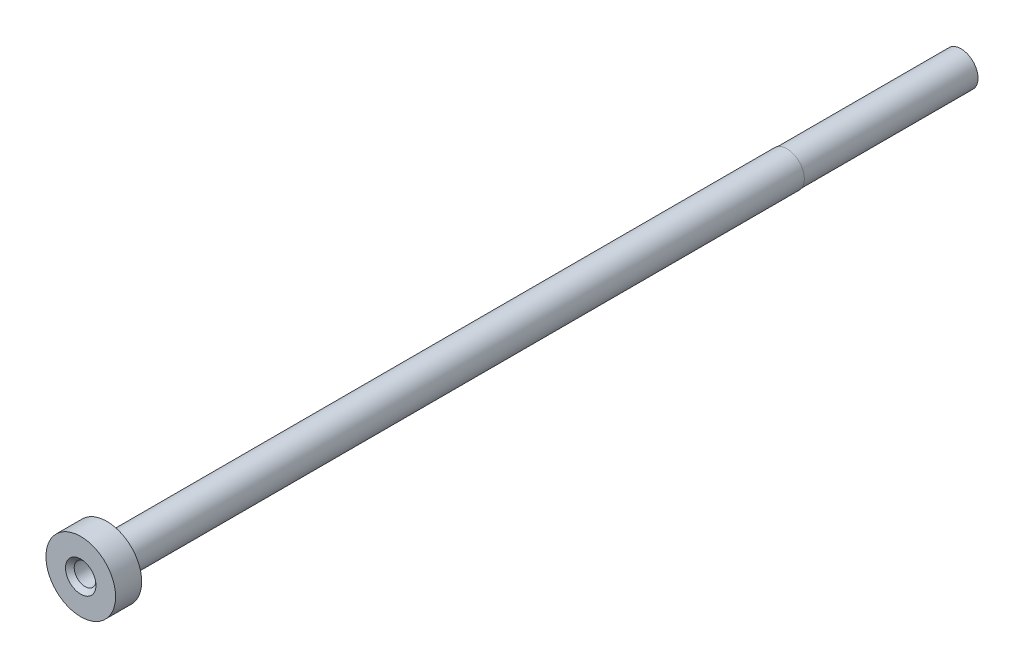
ISO-10303-21;
HEADER;
FILE_DESCRIPTION(('STEP AP214'),'2;1');
FILE_NAME('part.step','',(''),(''),'','','');
FILE_SCHEMA(('AUTOMOTIVE_DESIGN { 1 0 10303 214 1 1 1 1 }'));
ENDSEC;
DATA;
#1=APPLICATION_CONTEXT('core data for automotive mechanical design processes');
#2=APPLICATION_PROTOCOL_DEFINITION('international standard','automotive_design',2000,#1);
#3=PRODUCT_CONTEXT('',#1,'mechanical');
#4=PRODUCT('Part','Part','',(#3));
#5=PRODUCT_RELATED_PRODUCT_CATEGORY('part','',(#4));
#6=PRODUCT_DEFINITION_FORMATION('','',#4);
#7=PRODUCT_DEFINITION_CONTEXT('part definition',#1,'design');
#8=PRODUCT_DEFINITION('design','',#6,#7);
#9=PRODUCT_DEFINITION_SHAPE('','',#8);
#10=(LENGTH_UNIT() NAMED_UNIT(*) SI_UNIT(.MILLI.,.METRE.));
#11=(NAMED_UNIT(*) PLANE_ANGLE_UNIT() SI_UNIT($,.RADIAN.));
#12=(NAMED_UNIT(*) SI_UNIT($,.STERADIAN.) SOLID_ANGLE_UNIT());
#13=UNCERTAINTY_MEASURE_WITH_UNIT(LENGTH_MEASURE(1.E-05),#10,'distance_accuracy_value','');
#14=(GEOMETRIC_REPRESENTATION_CONTEXT(3) GLOBAL_UNCERTAINTY_ASSIGNED_CONTEXT((#13)) GLOBAL_UNIT_ASSIGNED_CONTEXT((#10,
#11,#12)) REPRESENTATION_CONTEXT('',''));
#15=CARTESIAN_POINT('',(0.,0.,0.));
#16=DIRECTION('',(0.,0.,1.));
#17=DIRECTION('',(1.,0.,0.));
#18=AXIS2_PLACEMENT_3D('',#15,#16,#17);
#19=CARTESIAN_POINT('',(-24.54585,-0.509249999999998,-101.12425));
#20=DIRECTION('',(0.,0.,1.));
#21=DIRECTION('',(1.,0.,0.));
#22=AXIS2_PLACEMENT_3D('',#19,#20,#21);
#23=PLANE('',#22);
#24=CARTESIAN_POINT('',(0.,0.,-101.12425));
#25=DIRECTION('',(0.,0.,1.));
#26=DIRECTION('',(1.,0.,0.));
#27=AXIS2_PLACEMENT_3D('',#24,#25,#26);
#28=CIRCLE('',#27,1.1);
#29=CARTESIAN_POINT('',(1.1,0.,-101.12425));
#30=VERTEX_POINT('',#29);
#31=EDGE_CURVE('E61',#30,#30,#28,.F.);
#32=ORIENTED_EDGE('',*,*,#31,.F.);
#33=EDGE_LOOP('',(#32));
#34=FACE_BOUND('',#33,.T.);
#35=CARTESIAN_POINT('',(0.,0.,-101.12425));
#36=DIRECTION('',(0.,0.,-1.));
#37=DIRECTION('',(-1.,0.,0.));
#38=AXIS2_PLACEMENT_3D('',#35,#36,#37);
#39=CIRCLE('',#38,1.95256100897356);
#40=CARTESIAN_POINT('',(-1.95256100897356,0.,-101.12425));
#41=VERTEX_POINT('',#40);
#42=EDGE_CURVE('E67',#41,#41,#39,.T.);
#43=ORIENTED_EDGE('',*,*,#42,.T.);
#44=EDGE_LOOP('',(#43));
#45=FACE_BOUND('',#44,.T.);
#46=ADVANCED_FACE('F29',(#34,#45),#23,.F.);
#47=CARTESIAN_POINT('',(0.,0.,-3.));
#48=DIRECTION('',(0.,0.,1.));
#49=DIRECTION('',(1.,0.,0.));
#50=AXIS2_PLACEMENT_3D('',#47,#48,#49);
#51=PLANE('',#50);
#52=CARTESIAN_POINT('',(0.,0.,-3.));
#53=DIRECTION('',(0.,0.,1.));
#54=DIRECTION('',(1.,0.,0.));
#55=AXIS2_PLACEMENT_3D('',#52,#53,#54);
#56=CIRCLE('',#55,2.3);
#57=CARTESIAN_POINT('',(2.3,0.,-3.));
#58=VERTEX_POINT('',#57);
#59=EDGE_CURVE('E40',#58,#58,#56,.T.);
#60=ORIENTED_EDGE('',*,*,#59,.T.);
#61=EDGE_LOOP('',(#60));
#62=FACE_BOUND('',#61,.T.);
#63=CARTESIAN_POINT('',(0.,0.,-3.));
#64=DIRECTION('',(0.,0.,1.));
#65=DIRECTION('',(1.,0.,0.));
#66=AXIS2_PLACEMENT_3D('',#63,#64,#65);
#67=CIRCLE('',#66,4.);
#68=CARTESIAN_POINT('',(4.,0.,-3.));
#69=VERTEX_POINT('',#68);
#70=EDGE_CURVE('E49',#69,#69,#67,.T.);
#71=ORIENTED_EDGE('',*,*,#70,.F.);
#72=EDGE_LOOP('',(#71));
#73=FACE_BOUND('',#72,.T.);
#74=ADVANCED_FACE('F90',(#62,#73),#51,.F.);
#75=CARTESIAN_POINT('',(0.,0.,-3.));
#76=DIRECTION('',(0.,0.,1.));
#77=DIRECTION('',(1.,0.,0.));
#78=AXIS2_PLACEMENT_3D('',#75,#76,#77);
#79=CYLINDRICAL_SURFACE('',#78,4.);
#80=ORIENTED_EDGE('',*,*,#70,.T.);
#81=EDGE_LOOP('',(#80));
#82=FACE_BOUND('',#81,.T.);
#83=CARTESIAN_POINT('',(0.,0.,0.));
#84=DIRECTION('',(0.,0.,1.));
#85=DIRECTION('',(1.,0.,0.));
#86=AXIS2_PLACEMENT_3D('',#83,#84,#85);
#87=CIRCLE('',#86,4.);
#88=CARTESIAN_POINT('',(4.,0.,0.));
#89=VERTEX_POINT('',#88);
#90=EDGE_CURVE('E52',#89,#89,#87,.T.);
#91=ORIENTED_EDGE('',*,*,#90,.F.);
#92=EDGE_LOOP('',(#91));
#93=FACE_BOUND('',#92,.T.);
#94=ADVANCED_FACE('F31',(#82,#93),#79,.T.);
#95=CARTESIAN_POINT('',(0.,0.,0.));
#96=DIRECTION('',(0.,0.,1.));
#97=DIRECTION('',(1.,0.,0.));
#98=AXIS2_PLACEMENT_3D('',#95,#96,#97);
#99=PLANE('',#98);
#100=CARTESIAN_POINT('',(0.,0.,0.));
#101=DIRECTION('',(0.,0.,1.));
#102=DIRECTION('',(1.,0.,0.));
#103=AXIS2_PLACEMENT_3D('',#100,#101,#102);
#104=CIRCLE('',#103,1.75);
#105=CARTESIAN_POINT('',(1.75,0.,0.));
#106=VERTEX_POINT('',#105);
#107=EDGE_CURVE('E11',#106,#106,#104,.F.);
#108=ORIENTED_EDGE('',*,*,#107,.T.);
#109=EDGE_LOOP('',(#108));
#110=FACE_BOUND('',#109,.T.);
#111=ORIENTED_EDGE('',*,*,#90,.T.);
#112=EDGE_LOOP('',(#111));
#113=FACE_BOUND('',#112,.T.);
#114=ADVANCED_FACE('F119',(#110,#113),#99,.T.);
#115=CARTESIAN_POINT('',(0.,0.,-255.656854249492));
#116=DIRECTION('',(0.,0.,1.));
#117=DIRECTION('',(1.,0.,0.));
#118=AXIS2_PLACEMENT_3D('',#115,#116,#117);
#119=CYLINDRICAL_SURFACE('',#118,2.);
#120=CARTESIAN_POINT('',(0.,0.,-81.12425));
#121=DIRECTION('',(0.,0.,1.));
#122=DIRECTION('',(1.,0.,0.));
#123=AXIS2_PLACEMENT_3D('',#120,#121,#122);
#124=CIRCLE('',#123,2.);
#125=CARTESIAN_POINT('',(2.,0.,-81.12425));
#126=VERTEX_POINT('',#125);
#127=EDGE_CURVE('E68',#126,#126,#124,.F.);
#128=ORIENTED_EDGE('',*,*,#127,.F.);
#129=EDGE_LOOP('',(#128));
#130=FACE_BOUND('',#129,.T.);
#131=CARTESIAN_POINT('',(0.,0.,-3.30000000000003));
#132=DIRECTION('',(0.,0.,1.));
#133=DIRECTION('',(1.,0.,0.));
#134=AXIS2_PLACEMENT_3D('',#131,#132,#133);
#135=CIRCLE('',#134,2.);
#136=CARTESIAN_POINT('',(2.,0.,-3.30000000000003));
#137=VERTEX_POINT('',#136);
#138=EDGE_CURVE('E44',#137,#137,#135,.F.);
#139=ORIENTED_EDGE('',*,*,#138,.T.);
#140=EDGE_LOOP('',(#139));
#141=FACE_BOUND('',#140,.T.);
#142=ADVANCED_FACE('F116',(#130,#141),#119,.T.);
#143=CARTESIAN_POINT('',(0.,0.,-128.535533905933));
#144=DIRECTION('',(0.,0.,1.));
#145=DIRECTION('',(1.,0.,0.));
#146=AXIS2_PLACEMENT_3D('',#143,#144,#145);
#147=CYLINDRICAL_SURFACE('',#146,1.25);
#148=CARTESIAN_POINT('',(0.,0.,-0.5));
#149=DIRECTION('',(0.,0.,1.));
#150=DIRECTION('',(1.,0.,0.));
#151=AXIS2_PLACEMENT_3D('',#148,#149,#150);
#152=CIRCLE('',#151,1.25);
#153=CARTESIAN_POINT('',(1.25,0.,-0.5));
#154=VERTEX_POINT('',#153);
#155=EDGE_CURVE('E36',#154,#154,#152,.T.);
#156=ORIENTED_EDGE('',*,*,#155,.T.);
#157=EDGE_LOOP('',(#156));
#158=FACE_BOUND('',#157,.T.);
#159=CARTESIAN_POINT('',(0.,0.,-90.));
#160=DIRECTION('',(0.,0.,1.));
#161=DIRECTION('',(1.,0.,0.));
#162=AXIS2_PLACEMENT_3D('',#159,#160,#161);
#163=CIRCLE('',#162,1.25);
#164=CARTESIAN_POINT('',(1.25,0.,-90.));
#165=VERTEX_POINT('',#164);
#166=EDGE_CURVE('E55',#165,#165,#163,.F.);
#167=ORIENTED_EDGE('',*,*,#166,.T.);
#168=EDGE_LOOP('',(#167));
#169=FACE_BOUND('',#168,.T.);
#170=ADVANCED_FACE('F112',(#158,#169),#147,.F.);
#171=CARTESIAN_POINT('',(0.,0.,-90.));
#172=DIRECTION('',(0.,0.,1.));
#173=DIRECTION('',(1.,0.,0.));
#174=AXIS2_PLACEMENT_3D('',#171,#172,#173);
#175=PLANE('',#174);
#176=CARTESIAN_POINT('',(0.,0.,-90.));
#177=DIRECTION('',(0.,0.,1.));
#178=DIRECTION('',(1.,0.,0.));
#179=AXIS2_PLACEMENT_3D('',#176,#177,#178);
#180=CIRCLE('',#179,1.1);
#181=CARTESIAN_POINT('',(1.1,0.,-90.));
#182=VERTEX_POINT('',#181);
#183=EDGE_CURVE('E58',#182,#182,#180,.F.);
#184=ORIENTED_EDGE('',*,*,#183,.T.);
#185=EDGE_LOOP('',(#184));
#186=FACE_BOUND('',#185,.T.);
#187=ORIENTED_EDGE('',*,*,#166,.F.);
#188=EDGE_LOOP('',(#187));
#189=FACE_BOUND('',#188,.T.);
#190=ADVANCED_FACE('F108',(#186,#189),#175,.T.);
#191=CARTESIAN_POINT('',(0.,0.,0.001000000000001));
#192=DIRECTION('',(0.,0.,-1.));
#193=DIRECTION('',(-1.,0.,0.));
#194=AXIS2_PLACEMENT_3D('',#191,#192,#193);
#195=CYLINDRICAL_SURFACE('',#194,1.1);
#196=ORIENTED_EDGE('',*,*,#31,.T.);
#197=EDGE_LOOP('',(#196));
#198=FACE_BOUND('',#197,.T.);
#199=ORIENTED_EDGE('',*,*,#183,.F.);
#200=EDGE_LOOP('',(#199));
#201=FACE_BOUND('',#200,.T.);
#202=ADVANCED_FACE('F104',(#198,#201),#195,.F.);
#203=CARTESIAN_POINT('',(0.,0.,-3.30000000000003));
#204=DIRECTION('',(0.,0.,1.));
#205=DIRECTION('',(1.,0.,0.));
#206=AXIS2_PLACEMENT_3D('',#203,#204,#205);
#207=TOROIDAL_SURFACE('',#206,2.3,0.3);
#208=ORIENTED_EDGE('',*,*,#59,.F.);
#209=EDGE_LOOP('',(#208));
#210=FACE_BOUND('',#209,.T.);
#211=ORIENTED_EDGE('',*,*,#138,.F.);
#212=EDGE_LOOP('',(#211));
#213=FACE_BOUND('',#212,.T.);
#214=ADVANCED_FACE('F100',(#210,#213),#207,.F.);
#215=CARTESIAN_POINT('',(0.,0.,-0.5));
#216=DIRECTION('',(0.,0.,1.));
#217=DIRECTION('',(1.,0.,0.));
#218=AXIS2_PLACEMENT_3D('',#215,#216,#217);
#219=CONICAL_SURFACE('',#218,1.25,0.78539816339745);
#220=ORIENTED_EDGE('',*,*,#107,.F.);
#221=EDGE_LOOP('',(#220));
#222=FACE_BOUND('',#221,.T.);
#223=ORIENTED_EDGE('',*,*,#155,.F.);
#224=EDGE_LOOP('',(#223));
#225=FACE_BOUND('',#224,.T.);
#226=ADVANCED_FACE('F79',(#222,#225),#219,.F.);
#227=CARTESIAN_POINT('',(0.,0.,-75.4673957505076));
#228=DIRECTION('',(0.,0.,-1.));
#229=DIRECTION('',(-1.,0.,0.));
#230=AXIS2_PLACEMENT_3D('',#227,#228,#229);
#231=CYLINDRICAL_SURFACE('',#230,1.95256100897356);
#232=ORIENTED_EDGE('',*,*,#42,.F.);
#233=EDGE_LOOP('',(#232));
#234=FACE_BOUND('',#233,.T.);
#235=CARTESIAN_POINT('',(0.,0.,-81.12425));
#236=DIRECTION('',(0.,0.,1.));
#237=DIRECTION('',(1.,0.,0.));
#238=AXIS2_PLACEMENT_3D('',#235,#236,#237);
#239=CIRCLE('',#238,1.95256100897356);
#240=CARTESIAN_POINT('',(1.95256100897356,0.,-81.12425));
#241=VERTEX_POINT('',#240);
#242=EDGE_CURVE('E64',#241,#241,#239,.F.);
#243=ORIENTED_EDGE('',*,*,#242,.T.);
#244=EDGE_LOOP('',(#243));
#245=FACE_BOUND('',#244,.T.);
#246=ADVANCED_FACE('F75',(#234,#245),#231,.T.);
#247=CARTESIAN_POINT('',(-12.0183,3.310125,-81.12425));
#248=DIRECTION('',(0.,0.,1.));
#249=DIRECTION('',(1.,0.,0.));
#250=AXIS2_PLACEMENT_3D('',#247,#248,#249);
#251=PLANE('',#250);
#252=ORIENTED_EDGE('',*,*,#127,.T.);
#253=EDGE_LOOP('',(#252));
#254=FACE_BOUND('',#253,.T.);
#255=ORIENTED_EDGE('',*,*,#242,.F.);
#256=EDGE_LOOP('',(#255));
#257=FACE_BOUND('',#256,.T.);
#258=ADVANCED_FACE('F78',(#254,#257),#251,.F.);
#259=CLOSED_SHELL('',(#46,#74,#94,#114,#142,#170,#190,#202,#214,#226,#246,#258));
#260=MANIFOLD_SOLID_BREP('B2',#259);
#261=ADVANCED_BREP_SHAPE_REPRESENTATION('',(#18,#260),#14);
#262=SHAPE_DEFINITION_REPRESENTATION(#9,#261);
ENDSEC;
END-ISO-10303-21;
